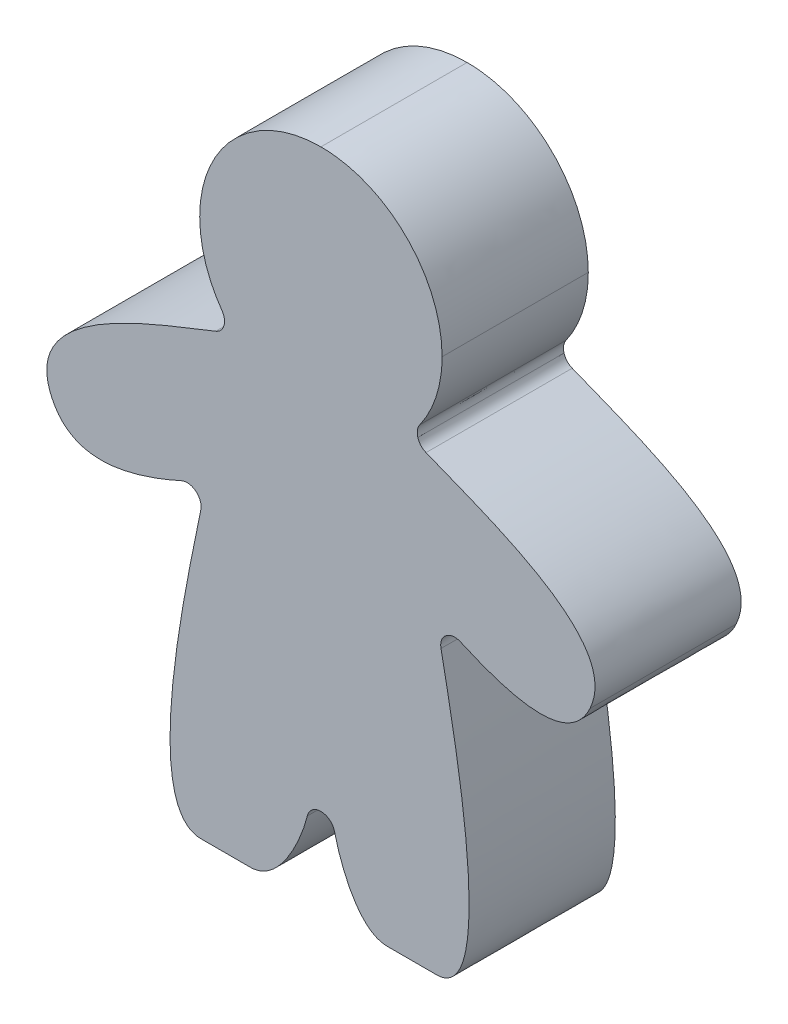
from build123d import *

# Parameters (mm, degrees)
BOSS_EXTRUDE1_DEPTH = 8


with BuildPart() as part:
    # Sketch1 → Boss-Extrude1 (new body)
    with BuildSketch(Plane.XY):
        with BuildLine():
            Line((385.57579816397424, 251.49269934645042), (382.88539549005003, 251.49269911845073))
            add(Edge.make_bspline(
                [(382.88539549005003, 251.49269911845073), (381.2546960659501, 251.49269979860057), (380.29689630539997, 254.21329911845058), (380.0005963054, 255.47969911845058)],
                knots=[0.04000001, 0.04000001, 0.04000001, 0.04000001, 0.08, 0.08, 0.08, 0.08], degree=3))
            add(Edge.make_bspline(
                [(380.0005963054, 255.47969911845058), (379.91859627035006, 255.8301990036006), (379.6143963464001, 256.07179894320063), (379.25389634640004, 256.07179894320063)],
                knots=[0.08000001, 0.08000001, 0.08000001, 0.08000001, 0.12, 0.12, 0.12, 0.12], degree=3))
            add(Edge.make_bspline(
                [(379.25389634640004, 256.07179894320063), (378.8932964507, 256.0716988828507), (378.58929652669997, 255.83009894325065), (378.50729652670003, 255.47969894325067)],
                knots=[0.12000000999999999, 0.12000000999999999, 0.12000000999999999, 0.12000000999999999, 0.16, 0.16, 0.16, 0.16], degree=3))
            add(Edge.make_bspline(
                [(378.50729652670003, 255.47969894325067), (378.2109963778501, 254.21329889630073), (377.0229966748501, 251.49269957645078), (375.39229667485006, 251.49269957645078)],
                knots=[0.16000001, 0.16000001, 0.16000001, 0.16000001, 0.2, 0.2, 0.2, 0.2], degree=3))
            add(Edge.make_bspline(
                [(375.39229667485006, 251.49269957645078), (375.3922960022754, 251.49269957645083), (372.7019966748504, 251.49269957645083)],
                knots=[0.20000001, 0.20000001, 0.20000001, 0.24, 0.24, 0.24], degree=2))
            add(Edge.make_bspline(
                [(372.7019966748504, 251.49269957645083), (369.15929919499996, 251.4927027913), (372.15449844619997, 264.35209957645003), (372.6824984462, 267.07959957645)],
                knots=[0.24000000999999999, 0.24000000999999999, 0.24000000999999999, 0.24000000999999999, 0.28, 0.28, 0.28, 0.28], degree=3))
            add(Edge.make_bspline(
                [(372.6824984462, 267.07959957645), (372.738198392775, 267.36789950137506), (372.63589841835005, 267.64419943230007), (372.40559841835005, 267.82659943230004)],
                knots=[0.28000001, 0.28000001, 0.28000001, 0.28000001, 0.32, 0.32, 0.32, 0.32], degree=3))
            add(Edge.make_bspline(
                [(372.40559841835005, 267.82659943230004), (372.1753984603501, 268.0088993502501), (371.88299853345, 268.04529934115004), (371.61509853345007, 267.92489934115)],
                knots=[0.32000001, 0.32000001, 0.32000001, 0.32000001, 0.36, 0.36, 0.36, 0.36], degree=3))
            add(Edge.make_bspline(
                [(371.61509853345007, 267.92489934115), (368.681999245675, 266.607199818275), (365.6647, 265.8803), (364.5327, 268.3081)],
                knots=[0.36000001, 0.36000001, 0.36000001, 0.36000001, 0.4, 0.4, 0.4, 0.4], degree=3))
            add(Edge.make_bspline(
                [(364.5327, 268.3081), (362.7603026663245, 272.10889869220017), (369.8808008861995, 274.4792980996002), (373.50150088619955, 275.9535980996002)],
                knots=[0.40000001, 0.40000001, 0.40000001, 0.40000001, 0.44, 0.44, 0.44, 0.44], degree=3))
            add(Edge.make_bspline(
                [(373.50150088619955, 275.9535980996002), (373.7257008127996, 276.0449980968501), (373.8805007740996, 276.2167980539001), (373.94830077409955, 276.4491980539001)],
                knots=[0.44000001, 0.44000001, 0.44000001, 0.44000001, 0.48, 0.48, 0.48, 0.48], degree=3))
            add(Edge.make_bspline(
                [(373.94830077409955, 276.4491980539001), (374.01620073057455, 276.6815979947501), (373.9779007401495, 276.90979793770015), (373.8380007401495, 277.10729793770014)],
                knots=[0.48000001, 0.48000001, 0.48000001, 0.48000001, 0.52, 0.52, 0.52, 0.52], degree=3))
            add(Edge.make_bspline(
                [(373.8380007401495, 277.10729793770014), (373.07200101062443, 278.1887977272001), (372.6219011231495, 279.50979739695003), (372.6219011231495, 280.93589739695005)],
                knots=[0.5200000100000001, 0.5200000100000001, 0.5200000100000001, 0.5200000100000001, 0.56, 0.56, 0.56, 0.56], degree=3))
            add(Edge.make_bspline(
                [(372.6219011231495, 280.93589739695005), (372.6219018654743, 284.5986963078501), (375.59120112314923, 287.5678955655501), (379.2539011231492, 287.5678955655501)],
                knots=[0.5600000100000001, 0.5600000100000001, 0.5600000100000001, 0.5600000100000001, 0.6, 0.6, 0.6, 0.6], degree=3))
            add(Edge.make_bspline(
                [(379.2539011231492, 287.5678955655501), (382.9167000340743, 287.5678948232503), (385.8859992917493, 284.5986955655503), (385.8859992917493, 280.9358955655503)],
                knots=[0.60000001, 0.60000001, 0.60000001, 0.60000001, 0.64, 0.64, 0.64, 0.64], degree=3))
            add(Edge.make_bspline(
                [(385.8859992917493, 280.9358955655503), (385.8859991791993, 279.5097959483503), (385.43579929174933, 278.1887962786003), (384.66989929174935, 277.1072962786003)],
                knots=[0.6400000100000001, 0.6400000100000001, 0.6400000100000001, 0.6400000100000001, 0.68, 0.68, 0.68, 0.68], degree=3))
            add(Edge.make_bspline(
                [(384.66989929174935, 277.1072962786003), (384.5299993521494, 276.9097963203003), (384.49179936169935, 276.6815963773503), (384.5595993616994, 276.4491963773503)],
                knots=[0.6800000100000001, 0.6800000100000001, 0.6800000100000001, 0.6800000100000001, 0.72, 0.72, 0.72, 0.72], degree=3))
            add(Edge.make_bspline(
                [(384.5595993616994, 276.4491963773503), (384.6273993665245, 276.21689645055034), (384.7822993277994, 276.0450964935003), (385.0063993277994, 275.95369649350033)],
                knots=[0.72000001, 0.72000001, 0.72000001, 0.72000001, 0.76, 0.76, 0.76, 0.76], degree=3))
            add(Edge.make_bspline(
                [(385.0063993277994, 275.95369649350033), (388.6269992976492, 274.4792966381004), (395.7475975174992, 272.10889723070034), (393.97519751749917, 268.3079972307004)],
                knots=[0.7600000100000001, 0.7600000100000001, 0.7600000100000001, 0.7600000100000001, 0.8, 0.8, 0.8, 0.8], degree=3))
            add(Edge.make_bspline(
                [(393.97519751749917, 268.3079972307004), (392.8431973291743, 265.88029862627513), (389.8258980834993, 266.60719844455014), (386.89289808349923, 267.9247984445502)],
                knots=[0.8000000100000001, 0.8000000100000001, 0.8000000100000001, 0.8000000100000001, 0.84, 0.84, 0.84, 0.84], degree=3))
            add(Edge.make_bspline(
                [(386.89289808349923, 267.9247984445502), (386.6249981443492, 268.0451983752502), (386.33259821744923, 268.00879838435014), (386.10229821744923, 267.8264983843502)],
                knots=[0.84000001, 0.84000001, 0.84000001, 0.84000001, 0.88, 0.88, 0.88, 0.88], degree=3))
            add(Edge.make_bspline(
                [(386.10229821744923, 267.8264983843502), (385.8720983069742, 267.6440984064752), (385.76979833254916, 267.3677984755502), (385.82549833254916, 267.0794984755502)],
                knots=[0.88000001, 0.88000001, 0.88000001, 0.88000001, 0.92, 0.92, 0.92, 0.92], degree=3))
            add(Edge.make_bspline(
                [(385.82549833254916, 267.0794984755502), (386.4997984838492, 263.59589783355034), (389.05879816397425, 251.49269934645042), (385.57579816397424, 251.49269934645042)],
                knots=[0.9200000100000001, 0.9200000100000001, 0.9200000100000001, 0.9200000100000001, 1, 1, 1, 1], degree=3))
        make_face()
    extrude(amount=BOSS_EXTRUDE1_DEPTH)


solid = part.part
